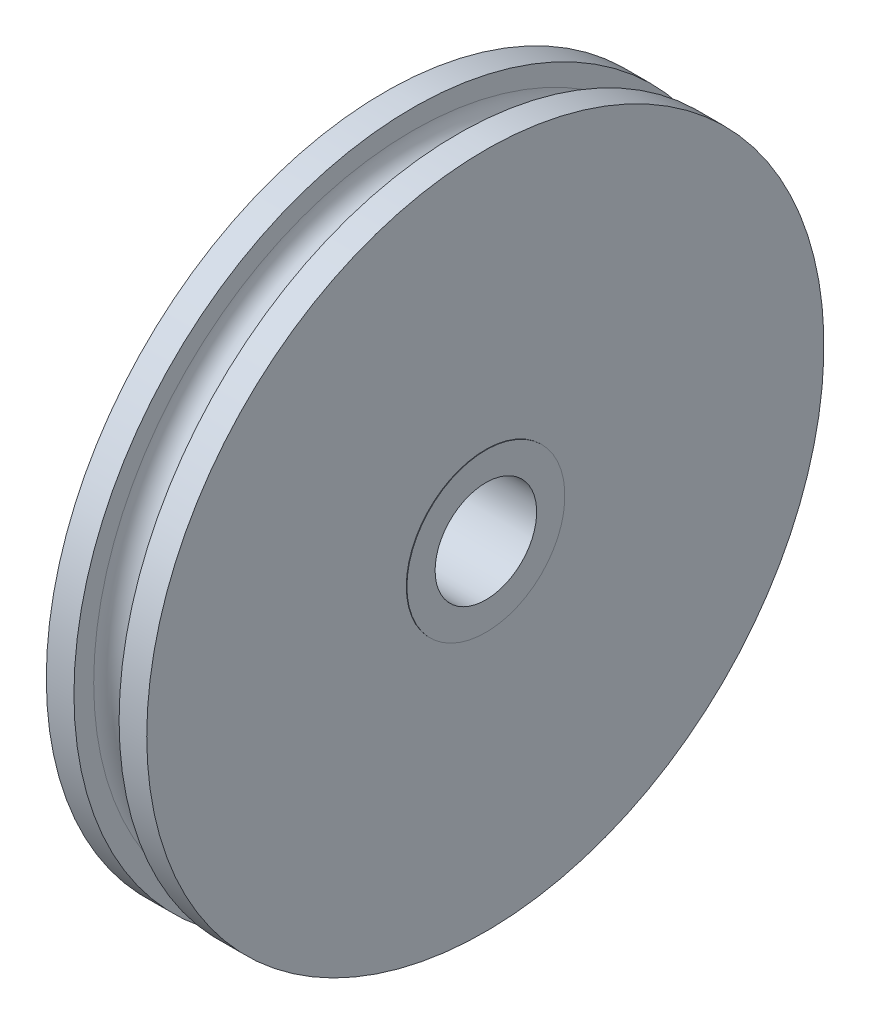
ISO-10303-21;
HEADER;
FILE_DESCRIPTION(('STEP AP214'),'2;1');
FILE_NAME('part.step','',(''),(''),'','','');
FILE_SCHEMA(('AUTOMOTIVE_DESIGN { 1 0 10303 214 1 1 1 1 }'));
ENDSEC;
DATA;
#1=APPLICATION_CONTEXT('core data for automotive mechanical design processes');
#2=APPLICATION_PROTOCOL_DEFINITION('international standard','automotive_design',2000,#1);
#3=PRODUCT_CONTEXT('',#1,'mechanical');
#4=PRODUCT('Part','Part','',(#3));
#5=PRODUCT_RELATED_PRODUCT_CATEGORY('part','',(#4));
#6=PRODUCT_DEFINITION_FORMATION('','',#4);
#7=PRODUCT_DEFINITION_CONTEXT('part definition',#1,'design');
#8=PRODUCT_DEFINITION('design','',#6,#7);
#9=PRODUCT_DEFINITION_SHAPE('','',#8);
#10=(LENGTH_UNIT() NAMED_UNIT(*) SI_UNIT(.MILLI.,.METRE.));
#11=(NAMED_UNIT(*) PLANE_ANGLE_UNIT() SI_UNIT($,.RADIAN.));
#12=(NAMED_UNIT(*) SI_UNIT($,.STERADIAN.) SOLID_ANGLE_UNIT());
#13=UNCERTAINTY_MEASURE_WITH_UNIT(LENGTH_MEASURE(1.E-05),#10,'distance_accuracy_value','');
#14=(GEOMETRIC_REPRESENTATION_CONTEXT(3) GLOBAL_UNCERTAINTY_ASSIGNED_CONTEXT((#13)) GLOBAL_UNIT_ASSIGNED_CONTEXT((#10,
#11,#12)) REPRESENTATION_CONTEXT('',''));
#15=CARTESIAN_POINT('',(0.,0.,0.));
#16=DIRECTION('',(0.,0.,1.));
#17=DIRECTION('',(1.,0.,0.));
#18=AXIS2_PLACEMENT_3D('',#15,#16,#17);
#19=CARTESIAN_POINT('',(0.,0.,0.));
#20=DIRECTION('',(-1.,0.,0.));
#21=DIRECTION('',(0.,0.,1.));
#22=AXIS2_PLACEMENT_3D('',#19,#20,#21);
#23=TOROIDAL_SURFACE('',#22,56.5,4.);
#24=CARTESIAN_POINT('',(-4.,0.,0.));
#25=DIRECTION('',(-1.,0.,0.));
#26=DIRECTION('',(0.,0.,1.));
#27=AXIS2_PLACEMENT_3D('',#24,#25,#26);
#28=CIRCLE('',#27,56.5);
#29=CARTESIAN_POINT('',(-4.,0.,56.5));
#30=VERTEX_POINT('',#29);
#31=EDGE_CURVE('E10',#30,#30,#28,.T.);
#32=ORIENTED_EDGE('',*,*,#31,.F.);
#33=EDGE_LOOP('',(#32));
#34=FACE_BOUND('',#33,.T.);
#35=CARTESIAN_POINT('',(4.,0.,0.));
#36=DIRECTION('',(-1.,0.,0.));
#37=DIRECTION('',(0.,0.,1.));
#38=AXIS2_PLACEMENT_3D('',#35,#36,#37);
#39=CIRCLE('',#38,56.5);
#40=CARTESIAN_POINT('',(4.,0.,56.5));
#41=VERTEX_POINT('',#40);
#42=EDGE_CURVE('E69',#41,#41,#39,.T.);
#43=ORIENTED_EDGE('',*,*,#42,.T.);
#44=EDGE_LOOP('',(#43));
#45=FACE_BOUND('',#44,.T.);
#46=ADVANCED_FACE('F29',(#34,#45),#23,.F.);
#47=CARTESIAN_POINT('',(-4.,0.,-60.));
#48=DIRECTION('',(-1.,0.,0.));
#49=DIRECTION('',(0.,0.,1.));
#50=AXIS2_PLACEMENT_3D('',#47,#48,#49);
#51=PLANE('',#50);
#52=CARTESIAN_POINT('',(-4.,0.,0.));
#53=DIRECTION('',(-1.,0.,0.));
#54=DIRECTION('',(0.,0.,1.));
#55=AXIS2_PLACEMENT_3D('',#52,#53,#54);
#56=CIRCLE('',#55,60.);
#57=CARTESIAN_POINT('',(-4.,0.,60.));
#58=VERTEX_POINT('',#57);
#59=EDGE_CURVE('E35',#58,#58,#56,.T.);
#60=ORIENTED_EDGE('',*,*,#59,.F.);
#61=EDGE_LOOP('',(#60));
#62=FACE_BOUND('',#61,.T.);
#63=ORIENTED_EDGE('',*,*,#31,.T.);
#64=EDGE_LOOP('',(#63));
#65=FACE_BOUND('',#64,.T.);
#66=ADVANCED_FACE('F130',(#62,#65),#51,.F.);
#67=CARTESIAN_POINT('',(-12.5,0.,0.));
#68=DIRECTION('',(-1.,0.,0.));
#69=DIRECTION('',(0.,0.,1.));
#70=AXIS2_PLACEMENT_3D('',#67,#68,#69);
#71=CYLINDRICAL_SURFACE('',#70,60.);
#72=CARTESIAN_POINT('',(-8.9,0.,0.));
#73=DIRECTION('',(-1.,0.,0.));
#74=DIRECTION('',(0.,0.,1.));
#75=AXIS2_PLACEMENT_3D('',#72,#73,#74);
#76=CIRCLE('',#75,60.);
#77=CARTESIAN_POINT('',(-8.9,0.,60.));
#78=VERTEX_POINT('',#77);
#79=EDGE_CURVE('E39',#78,#78,#76,.T.);
#80=ORIENTED_EDGE('',*,*,#79,.F.);
#81=EDGE_LOOP('',(#80));
#82=FACE_BOUND('',#81,.T.);
#83=ORIENTED_EDGE('',*,*,#59,.T.);
#84=EDGE_LOOP('',(#83));
#85=FACE_BOUND('',#84,.T.);
#86=ADVANCED_FACE('F125',(#82,#85),#71,.T.);
#87=CARTESIAN_POINT('',(-8.9,0.,-14.));
#88=DIRECTION('',(1.,0.,0.));
#89=DIRECTION('',(0.,0.,-1.));
#90=AXIS2_PLACEMENT_3D('',#87,#88,#89);
#91=PLANE('',#90);
#92=CARTESIAN_POINT('',(-8.9,0.,0.));
#93=DIRECTION('',(-1.,0.,0.));
#94=DIRECTION('',(0.,0.,1.));
#95=AXIS2_PLACEMENT_3D('',#92,#93,#94);
#96=CIRCLE('',#95,14.);
#97=CARTESIAN_POINT('',(-8.9,0.,14.));
#98=VERTEX_POINT('',#97);
#99=EDGE_CURVE('E43',#98,#98,#96,.T.);
#100=ORIENTED_EDGE('',*,*,#99,.F.);
#101=EDGE_LOOP('',(#100));
#102=FACE_BOUND('',#101,.T.);
#103=ORIENTED_EDGE('',*,*,#79,.T.);
#104=EDGE_LOOP('',(#103));
#105=FACE_BOUND('',#104,.T.);
#106=ADVANCED_FACE('F119',(#102,#105),#91,.F.);
#107=CARTESIAN_POINT('',(-12.5,0.,0.));
#108=DIRECTION('',(-1.,0.,0.));
#109=DIRECTION('',(0.,0.,1.));
#110=AXIS2_PLACEMENT_3D('',#107,#108,#109);
#111=CYLINDRICAL_SURFACE('',#110,14.);
#112=CARTESIAN_POINT('',(-9.,0.,0.));
#113=DIRECTION('',(-1.,0.,0.));
#114=DIRECTION('',(0.,0.,1.));
#115=AXIS2_PLACEMENT_3D('',#112,#113,#114);
#116=CIRCLE('',#115,14.);
#117=CARTESIAN_POINT('',(-9.,0.,14.));
#118=VERTEX_POINT('',#117);
#119=EDGE_CURVE('E48',#118,#118,#116,.T.);
#120=ORIENTED_EDGE('',*,*,#119,.F.);
#121=EDGE_LOOP('',(#120));
#122=FACE_BOUND('',#121,.T.);
#123=ORIENTED_EDGE('',*,*,#99,.T.);
#124=EDGE_LOOP('',(#123));
#125=FACE_BOUND('',#124,.T.);
#126=ADVANCED_FACE('F113',(#122,#125),#111,.T.);
#127=CARTESIAN_POINT('',(-9.,0.,-9.));
#128=DIRECTION('',(1.,0.,0.));
#129=DIRECTION('',(0.,0.,-1.));
#130=AXIS2_PLACEMENT_3D('',#127,#128,#129);
#131=PLANE('',#130);
#132=CARTESIAN_POINT('',(-9.,0.,0.));
#133=DIRECTION('',(-1.,0.,0.));
#134=DIRECTION('',(0.,0.,1.));
#135=AXIS2_PLACEMENT_3D('',#132,#133,#134);
#136=CIRCLE('',#135,9.);
#137=CARTESIAN_POINT('',(-9.,0.,9.));
#138=VERTEX_POINT('',#137);
#139=EDGE_CURVE('E51',#138,#138,#136,.T.);
#140=ORIENTED_EDGE('',*,*,#139,.F.);
#141=EDGE_LOOP('',(#140));
#142=FACE_BOUND('',#141,.T.);
#143=ORIENTED_EDGE('',*,*,#119,.T.);
#144=EDGE_LOOP('',(#143));
#145=FACE_BOUND('',#144,.T.);
#146=ADVANCED_FACE('F107',(#142,#145),#131,.F.);
#147=CARTESIAN_POINT('',(-12.5,0.,0.));
#148=DIRECTION('',(-1.,0.,0.));
#149=DIRECTION('',(0.,0.,1.));
#150=AXIS2_PLACEMENT_3D('',#147,#148,#149);
#151=CYLINDRICAL_SURFACE('',#150,9.);
#152=CARTESIAN_POINT('',(9.,0.,0.));
#153=DIRECTION('',(-1.,0.,0.));
#154=DIRECTION('',(0.,0.,1.));
#155=AXIS2_PLACEMENT_3D('',#152,#153,#154);
#156=CIRCLE('',#155,9.);
#157=CARTESIAN_POINT('',(9.,0.,9.));
#158=VERTEX_POINT('',#157);
#159=EDGE_CURVE('E54',#158,#158,#156,.T.);
#160=ORIENTED_EDGE('',*,*,#159,.F.);
#161=EDGE_LOOP('',(#160));
#162=FACE_BOUND('',#161,.T.);
#163=ORIENTED_EDGE('',*,*,#139,.T.);
#164=EDGE_LOOP('',(#163));
#165=FACE_BOUND('',#164,.T.);
#166=ADVANCED_FACE('F101',(#162,#165),#151,.F.);
#167=CARTESIAN_POINT('',(9.,0.,-9.));
#168=DIRECTION('',(-1.,0.,0.));
#169=DIRECTION('',(0.,0.,1.));
#170=AXIS2_PLACEMENT_3D('',#167,#168,#169);
#171=PLANE('',#170);
#172=CARTESIAN_POINT('',(9.,0.,0.));
#173=DIRECTION('',(-1.,0.,0.));
#174=DIRECTION('',(0.,0.,1.));
#175=AXIS2_PLACEMENT_3D('',#172,#173,#174);
#176=CIRCLE('',#175,14.);
#177=CARTESIAN_POINT('',(9.,0.,14.));
#178=VERTEX_POINT('',#177);
#179=EDGE_CURVE('E57',#178,#178,#176,.T.);
#180=ORIENTED_EDGE('',*,*,#179,.F.);
#181=EDGE_LOOP('',(#180));
#182=FACE_BOUND('',#181,.T.);
#183=ORIENTED_EDGE('',*,*,#159,.T.);
#184=EDGE_LOOP('',(#183));
#185=FACE_BOUND('',#184,.T.);
#186=ADVANCED_FACE('F95',(#182,#185),#171,.F.);
#187=CARTESIAN_POINT('',(-12.5,0.,0.));
#188=DIRECTION('',(-1.,0.,0.));
#189=DIRECTION('',(0.,0.,1.));
#190=AXIS2_PLACEMENT_3D('',#187,#188,#189);
#191=CYLINDRICAL_SURFACE('',#190,14.);
#192=CARTESIAN_POINT('',(8.9,0.,0.));
#193=DIRECTION('',(-1.,0.,0.));
#194=DIRECTION('',(0.,0.,1.));
#195=AXIS2_PLACEMENT_3D('',#192,#193,#194);
#196=CIRCLE('',#195,14.);
#197=CARTESIAN_POINT('',(8.9,0.,14.));
#198=VERTEX_POINT('',#197);
#199=EDGE_CURVE('E60',#198,#198,#196,.T.);
#200=ORIENTED_EDGE('',*,*,#199,.F.);
#201=EDGE_LOOP('',(#200));
#202=FACE_BOUND('',#201,.T.);
#203=ORIENTED_EDGE('',*,*,#179,.T.);
#204=EDGE_LOOP('',(#203));
#205=FACE_BOUND('',#204,.T.);
#206=ADVANCED_FACE('F89',(#202,#205),#191,.T.);
#207=CARTESIAN_POINT('',(8.9,0.,-14.));
#208=DIRECTION('',(-1.,0.,0.));
#209=DIRECTION('',(0.,0.,1.));
#210=AXIS2_PLACEMENT_3D('',#207,#208,#209);
#211=PLANE('',#210);
#212=CARTESIAN_POINT('',(8.9,0.,0.));
#213=DIRECTION('',(-1.,0.,0.));
#214=DIRECTION('',(0.,0.,1.));
#215=AXIS2_PLACEMENT_3D('',#212,#213,#214);
#216=CIRCLE('',#215,60.);
#217=CARTESIAN_POINT('',(8.9,0.,60.));
#218=VERTEX_POINT('',#217);
#219=EDGE_CURVE('E63',#218,#218,#216,.T.);
#220=ORIENTED_EDGE('',*,*,#219,.F.);
#221=EDGE_LOOP('',(#220));
#222=FACE_BOUND('',#221,.T.);
#223=ORIENTED_EDGE('',*,*,#199,.T.);
#224=EDGE_LOOP('',(#223));
#225=FACE_BOUND('',#224,.T.);
#226=ADVANCED_FACE('F83',(#222,#225),#211,.F.);
#227=CARTESIAN_POINT('',(-12.5,0.,0.));
#228=DIRECTION('',(-1.,0.,0.));
#229=DIRECTION('',(0.,0.,1.));
#230=AXIS2_PLACEMENT_3D('',#227,#228,#229);
#231=CYLINDRICAL_SURFACE('',#230,60.);
#232=CARTESIAN_POINT('',(4.,0.,0.));
#233=DIRECTION('',(-1.,0.,0.));
#234=DIRECTION('',(0.,0.,1.));
#235=AXIS2_PLACEMENT_3D('',#232,#233,#234);
#236=CIRCLE('',#235,60.);
#237=CARTESIAN_POINT('',(4.,0.,60.));
#238=VERTEX_POINT('',#237);
#239=EDGE_CURVE('E66',#238,#238,#236,.T.);
#240=ORIENTED_EDGE('',*,*,#239,.F.);
#241=EDGE_LOOP('',(#240));
#242=FACE_BOUND('',#241,.T.);
#243=ORIENTED_EDGE('',*,*,#219,.T.);
#244=EDGE_LOOP('',(#243));
#245=FACE_BOUND('',#244,.T.);
#246=ADVANCED_FACE('F77',(#242,#245),#231,.T.);
#247=CARTESIAN_POINT('',(4.,0.,-60.));
#248=DIRECTION('',(1.,0.,0.));
#249=DIRECTION('',(0.,0.,-1.));
#250=AXIS2_PLACEMENT_3D('',#247,#248,#249);
#251=PLANE('',#250);
#252=ORIENTED_EDGE('',*,*,#42,.F.);
#253=EDGE_LOOP('',(#252));
#254=FACE_BOUND('',#253,.T.);
#255=ORIENTED_EDGE('',*,*,#239,.T.);
#256=EDGE_LOOP('',(#255));
#257=FACE_BOUND('',#256,.T.);
#258=ADVANCED_FACE('F74',(#254,#257),#251,.F.);
#259=CLOSED_SHELL('',(#46,#66,#86,#106,#126,#146,#166,#186,#206,#226,#246,#258));
#260=MANIFOLD_SOLID_BREP('B2',#259);
#261=ADVANCED_BREP_SHAPE_REPRESENTATION('',(#18,#260),#14);
#262=SHAPE_DEFINITION_REPRESENTATION(#9,#261);
ENDSEC;
END-ISO-10303-21;
